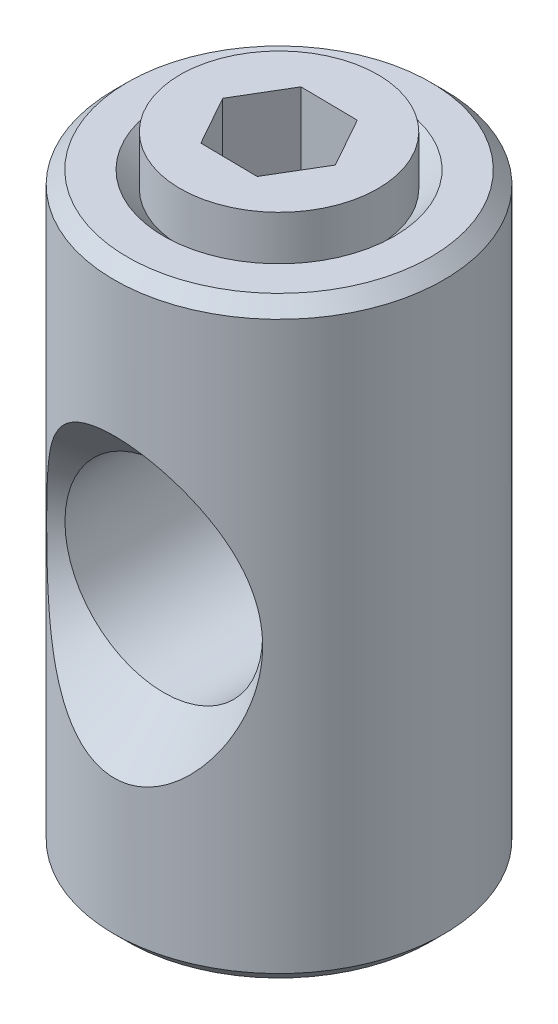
ISO-10303-21;
HEADER;
FILE_DESCRIPTION(('STEP AP214'),'2;1');
FILE_NAME('part.step','',(''),(''),'','','');
FILE_SCHEMA(('AUTOMOTIVE_DESIGN { 1 0 10303 214 1 1 1 1 }'));
ENDSEC;
DATA;
#1=APPLICATION_CONTEXT('core data for automotive mechanical design processes');
#2=APPLICATION_PROTOCOL_DEFINITION('international standard','automotive_design',2000,#1);
#3=PRODUCT_CONTEXT('',#1,'mechanical');
#4=PRODUCT('Part','Part','',(#3));
#5=PRODUCT_RELATED_PRODUCT_CATEGORY('part','',(#4));
#6=PRODUCT_DEFINITION_FORMATION('','',#4);
#7=PRODUCT_DEFINITION_CONTEXT('part definition',#1,'design');
#8=PRODUCT_DEFINITION('design','',#6,#7);
#9=PRODUCT_DEFINITION_SHAPE('','',#8);
#10=(LENGTH_UNIT() NAMED_UNIT(*) SI_UNIT(.MILLI.,.METRE.));
#11=(NAMED_UNIT(*) PLANE_ANGLE_UNIT() SI_UNIT($,.RADIAN.));
#12=(NAMED_UNIT(*) SI_UNIT($,.STERADIAN.) SOLID_ANGLE_UNIT());
#13=UNCERTAINTY_MEASURE_WITH_UNIT(LENGTH_MEASURE(1.E-05),#10,'distance_accuracy_value','');
#14=(GEOMETRIC_REPRESENTATION_CONTEXT(3) GLOBAL_UNCERTAINTY_ASSIGNED_CONTEXT((#13)) GLOBAL_UNIT_ASSIGNED_CONTEXT((#10,
#11,#12)) REPRESENTATION_CONTEXT('',''));
#15=CARTESIAN_POINT('',(0.,0.,0.));
#16=DIRECTION('',(0.,0.,1.));
#17=DIRECTION('',(1.,0.,0.));
#18=AXIS2_PLACEMENT_3D('',#15,#16,#17);
#19=CARTESIAN_POINT('',(0.,2.,0.));
#20=DIRECTION('',(0.,-1.,0.));
#21=DIRECTION('',(0.999915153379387,0.,0.0130263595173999));
#22=AXIS2_PLACEMENT_3D('',#19,#20,#21);
#23=CYLINDRICAL_SURFACE('',#22,1.5);
#24=CARTESIAN_POINT('',(0.,5.,0.));
#25=DIRECTION('',(0.,-1.,0.));
#26=DIRECTION('',(0.999915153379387,0.,0.0130263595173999));
#27=AXIS2_PLACEMENT_3D('',#24,#25,#26);
#28=CIRCLE('',#27,1.5);
#29=CARTESIAN_POINT('',(1.49987273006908,5.,0.0195395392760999));
#30=VERTEX_POINT('',#29);
#31=EDGE_CURVE('E118',#30,#30,#28,.T.);
#32=ORIENTED_EDGE('',*,*,#31,.T.);
#33=EDGE_LOOP('',(#32));
#34=FACE_BOUND('',#33,.T.);
#35=CARTESIAN_POINT('',(0.,4.25,0.));
#36=DIRECTION('',(0.,1.,0.));
#37=DIRECTION('',(-1.,0.,0.));
#38=AXIS2_PLACEMENT_3D('',#35,#36,#37);
#39=CIRCLE('',#38,1.5);
#40=CARTESIAN_POINT('',(-1.5,4.25,0.));
#41=VERTEX_POINT('',#40);
#42=EDGE_CURVE('E9',#41,#41,#39,.T.);
#43=ORIENTED_EDGE('',*,*,#42,.T.);
#44=EDGE_LOOP('',(#43));
#45=FACE_BOUND('',#44,.T.);
#46=ADVANCED_FACE('F14',(#34,#45),#23,.T.);
#47=CARTESIAN_POINT('',(0.,5.,0.));
#48=DIRECTION('',(0.,-1.,0.));
#49=DIRECTION('',(0.999915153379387,0.,0.0130263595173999));
#50=AXIS2_PLACEMENT_3D('',#47,#48,#49);
#51=PLANE('',#50);
#52=DIRECTION('',(0.488676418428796,0.,0.872465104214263));
#53=VECTOR('',#52,1.);
#54=CARTESIAN_POINT('',(-0.865951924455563,5.,-0.0112811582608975));
#55=LINE('',#54,#53);
#56=CARTESIAN_POINT('',(-0.865951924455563,5.,-0.0112811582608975));
#57=VERTEX_POINT('',#56);
#58=CARTESIAN_POINT('',(-0.442745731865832,5.,0.744295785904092));
#59=VERTEX_POINT('',#58);
#60=EDGE_CURVE('E104',#57,#59,#55,.T.);
#61=ORIENTED_EDGE('',*,*,#60,.F.);
#62=DIRECTION('',(-0.511238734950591,0.,0.859438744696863));
#63=VECTOR('',#62,1.);
#64=CARTESIAN_POINT('',(-0.423206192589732,5.,-0.755576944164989));
#65=LINE('',#64,#63);
#66=CARTESIAN_POINT('',(-0.423206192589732,5.,-0.755576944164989));
#67=VERTEX_POINT('',#66);
#68=EDGE_CURVE('E30',#67,#57,#65,.T.);
#69=ORIENTED_EDGE('',*,*,#68,.F.);
#70=DIRECTION('',(-0.999915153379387,0.,-0.0130263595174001));
#71=VECTOR('',#70,1.);
#72=CARTESIAN_POINT('',(0.442745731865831,5.,-0.744295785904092));
#73=LINE('',#72,#71);
#74=CARTESIAN_POINT('',(0.442745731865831,5.,-0.744295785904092));
#75=VERTEX_POINT('',#74);
#76=EDGE_CURVE('E114',#75,#67,#73,.T.);
#77=ORIENTED_EDGE('',*,*,#76,.F.);
#78=DIRECTION('',(-0.488676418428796,0.,-0.872465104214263));
#79=VECTOR('',#78,1.);
#80=CARTESIAN_POINT('',(0.865951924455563,5.,0.0112811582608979));
#81=LINE('',#80,#79);
#82=CARTESIAN_POINT('',(0.865951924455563,5.,0.0112811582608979));
#83=VERTEX_POINT('',#82);
#84=EDGE_CURVE('E112',#83,#75,#81,.T.);
#85=ORIENTED_EDGE('',*,*,#84,.F.);
#86=DIRECTION('',(0.511238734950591,0.,-0.859438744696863));
#87=VECTOR('',#86,1.);
#88=CARTESIAN_POINT('',(0.423206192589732,5.,0.755576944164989));
#89=LINE('',#88,#87);
#90=CARTESIAN_POINT('',(0.423206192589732,5.,0.755576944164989));
#91=VERTEX_POINT('',#90);
#92=EDGE_CURVE('E78',#91,#83,#89,.T.);
#93=ORIENTED_EDGE('',*,*,#92,.F.);
#94=DIRECTION('',(0.999915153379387,0.,0.0130263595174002));
#95=VECTOR('',#94,1.);
#96=CARTESIAN_POINT('',(-0.442745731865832,5.,0.744295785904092));
#97=LINE('',#96,#95);
#98=EDGE_CURVE('E108',#59,#91,#97,.T.);
#99=ORIENTED_EDGE('',*,*,#98,.F.);
#100=EDGE_LOOP('',(#61,#69,#77,#85,#93,#99));
#101=FACE_BOUND('',#100,.T.);
#102=ORIENTED_EDGE('',*,*,#31,.F.);
#103=EDGE_LOOP('',(#102));
#104=FACE_BOUND('',#103,.T.);
#105=ADVANCED_FACE('F226',(#101,#104),#51,.F.);
#106=CARTESIAN_POINT('',(-0.423206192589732,3.8,-0.755576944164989));
#107=DIRECTION('',(-0.859438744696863,0.,-0.511238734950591));
#108=DIRECTION('',(-0.511238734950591,0.,0.859438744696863));
#109=AXIS2_PLACEMENT_3D('',#106,#107,#108);
#110=PLANE('',#109);
#111=ORIENTED_EDGE('',*,*,#68,.T.);
#112=DIRECTION('',(0.,1.,0.));
#113=VECTOR('',#112,1.);
#114=CARTESIAN_POINT('',(-0.865951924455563,3.8,-0.0112811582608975));
#115=LINE('',#114,#113);
#116=CARTESIAN_POINT('',(-0.865951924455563,3.8,-0.0112811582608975));
#117=VERTEX_POINT('',#116);
#118=EDGE_CURVE('E60',#117,#57,#115,.T.);
#119=ORIENTED_EDGE('',*,*,#118,.F.);
#120=DIRECTION('',(-0.511238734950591,0.,0.859438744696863));
#121=VECTOR('',#120,1.);
#122=CARTESIAN_POINT('',(-0.423206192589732,3.8,-0.755576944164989));
#123=LINE('',#122,#121);
#124=CARTESIAN_POINT('',(-0.423206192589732,3.8,-0.755576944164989));
#125=VERTEX_POINT('',#124);
#126=EDGE_CURVE('E116',#125,#117,#123,.T.);
#127=ORIENTED_EDGE('',*,*,#126,.F.);
#128=DIRECTION('',(0.,1.,0.));
#129=VECTOR('',#128,1.);
#130=CARTESIAN_POINT('',(-0.423206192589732,3.8,-0.755576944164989));
#131=LINE('',#130,#129);
#132=EDGE_CURVE('E38',#125,#67,#131,.T.);
#133=ORIENTED_EDGE('',*,*,#132,.T.);
#134=EDGE_LOOP('',(#111,#119,#127,#133));
#135=FACE_BOUND('',#134,.T.);
#136=ADVANCED_FACE('F213',(#135),#110,.F.);
#137=CARTESIAN_POINT('',(0.442745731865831,3.8,-0.744295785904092));
#138=DIRECTION('',(0.0130263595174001,0.,-0.999915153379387));
#139=DIRECTION('',(-0.999915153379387,0.,-0.0130263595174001));
#140=AXIS2_PLACEMENT_3D('',#137,#138,#139);
#141=PLANE('',#140);
#142=ORIENTED_EDGE('',*,*,#76,.T.);
#143=ORIENTED_EDGE('',*,*,#132,.F.);
#144=DIRECTION('',(-0.999915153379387,0.,-0.0130263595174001));
#145=VECTOR('',#144,1.);
#146=CARTESIAN_POINT('',(0.442745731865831,3.8,-0.744295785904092));
#147=LINE('',#146,#145);
#148=CARTESIAN_POINT('',(0.442745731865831,3.8,-0.744295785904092));
#149=VERTEX_POINT('',#148);
#150=EDGE_CURVE('E90',#149,#125,#147,.T.);
#151=ORIENTED_EDGE('',*,*,#150,.F.);
#152=DIRECTION('',(0.,1.,0.));
#153=VECTOR('',#152,1.);
#154=CARTESIAN_POINT('',(0.442745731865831,3.8,-0.744295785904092));
#155=LINE('',#154,#153);
#156=EDGE_CURVE('E82',#149,#75,#155,.T.);
#157=ORIENTED_EDGE('',*,*,#156,.T.);
#158=EDGE_LOOP('',(#142,#143,#151,#157));
#159=FACE_BOUND('',#158,.T.);
#160=ADVANCED_FACE('F210',(#159),#141,.F.);
#161=CARTESIAN_POINT('',(0.865951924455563,3.8,0.0112811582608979));
#162=DIRECTION('',(0.872465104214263,0.,-0.488676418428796));
#163=DIRECTION('',(-0.488676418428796,0.,-0.872465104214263));
#164=AXIS2_PLACEMENT_3D('',#161,#162,#163);
#165=PLANE('',#164);
#166=ORIENTED_EDGE('',*,*,#84,.T.);
#167=ORIENTED_EDGE('',*,*,#156,.F.);
#168=DIRECTION('',(-0.488676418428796,0.,-0.872465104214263));
#169=VECTOR('',#168,1.);
#170=CARTESIAN_POINT('',(0.865951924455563,3.8,0.0112811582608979));
#171=LINE('',#170,#169);
#172=CARTESIAN_POINT('',(0.865951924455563,3.8,0.0112811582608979));
#173=VERTEX_POINT('',#172);
#174=EDGE_CURVE('E86',#173,#149,#171,.T.);
#175=ORIENTED_EDGE('',*,*,#174,.F.);
#176=DIRECTION('',(0.,1.,0.));
#177=VECTOR('',#176,1.);
#178=CARTESIAN_POINT('',(0.865951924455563,3.8,0.0112811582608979));
#179=LINE('',#178,#177);
#180=EDGE_CURVE('E71',#173,#83,#179,.T.);
#181=ORIENTED_EDGE('',*,*,#180,.T.);
#182=EDGE_LOOP('',(#166,#167,#175,#181));
#183=FACE_BOUND('',#182,.T.);
#184=ADVANCED_FACE('F87',(#183),#165,.F.);
#185=CARTESIAN_POINT('',(0.423206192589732,3.8,0.755576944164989));
#186=DIRECTION('',(0.859438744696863,0.,0.511238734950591));
#187=DIRECTION('',(0.511238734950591,0.,-0.859438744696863));
#188=AXIS2_PLACEMENT_3D('',#185,#186,#187);
#189=PLANE('',#188);
#190=ORIENTED_EDGE('',*,*,#92,.T.);
#191=ORIENTED_EDGE('',*,*,#180,.F.);
#192=DIRECTION('',(0.511238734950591,0.,-0.859438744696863));
#193=VECTOR('',#192,1.);
#194=CARTESIAN_POINT('',(0.423206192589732,3.8,0.755576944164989));
#195=LINE('',#194,#193);
#196=CARTESIAN_POINT('',(0.423206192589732,3.8,0.755576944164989));
#197=VERTEX_POINT('',#196);
#198=EDGE_CURVE('E75',#197,#173,#195,.T.);
#199=ORIENTED_EDGE('',*,*,#198,.F.);
#200=DIRECTION('',(0.,1.,0.));
#201=VECTOR('',#200,1.);
#202=CARTESIAN_POINT('',(0.423206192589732,3.8,0.755576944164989));
#203=LINE('',#202,#201);
#204=EDGE_CURVE('E83',#197,#91,#203,.T.);
#205=ORIENTED_EDGE('',*,*,#204,.T.);
#206=EDGE_LOOP('',(#190,#191,#199,#205));
#207=FACE_BOUND('',#206,.T.);
#208=ADVANCED_FACE('F73',(#207),#189,.F.);
#209=CARTESIAN_POINT('',(-0.442745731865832,3.8,0.744295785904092));
#210=DIRECTION('',(-0.0130263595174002,0.,0.999915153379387));
#211=DIRECTION('',(0.999915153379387,0.,0.0130263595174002));
#212=AXIS2_PLACEMENT_3D('',#209,#210,#211);
#213=PLANE('',#212);
#214=ORIENTED_EDGE('',*,*,#98,.T.);
#215=ORIENTED_EDGE('',*,*,#204,.F.);
#216=DIRECTION('',(0.999915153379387,0.,0.0130263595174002));
#217=VECTOR('',#216,1.);
#218=CARTESIAN_POINT('',(-0.442745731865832,3.8,0.744295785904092));
#219=LINE('',#218,#217);
#220=CARTESIAN_POINT('',(-0.442745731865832,3.8,0.744295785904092));
#221=VERTEX_POINT('',#220);
#222=EDGE_CURVE('E96',#221,#197,#219,.T.);
#223=ORIENTED_EDGE('',*,*,#222,.F.);
#224=DIRECTION('',(0.,1.,0.));
#225=VECTOR('',#224,1.);
#226=CARTESIAN_POINT('',(-0.442745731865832,3.8,0.744295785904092));
#227=LINE('',#226,#225);
#228=EDGE_CURVE('E121',#221,#59,#227,.T.);
#229=ORIENTED_EDGE('',*,*,#228,.T.);
#230=EDGE_LOOP('',(#214,#215,#223,#229));
#231=FACE_BOUND('',#230,.T.);
#232=ADVANCED_FACE('F218',(#231),#213,.F.);
#233=CARTESIAN_POINT('',(-0.865951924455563,3.8,-0.0112811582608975));
#234=DIRECTION('',(-0.872465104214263,0.,0.488676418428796));
#235=DIRECTION('',(0.488676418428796,0.,0.872465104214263));
#236=AXIS2_PLACEMENT_3D('',#233,#234,#235);
#237=PLANE('',#236);
#238=ORIENTED_EDGE('',*,*,#60,.T.);
#239=ORIENTED_EDGE('',*,*,#228,.F.);
#240=DIRECTION('',(0.488676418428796,0.,0.872465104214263));
#241=VECTOR('',#240,1.);
#242=CARTESIAN_POINT('',(-0.865951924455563,3.8,-0.0112811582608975));
#243=LINE('',#242,#241);
#244=EDGE_CURVE('E98',#117,#221,#243,.T.);
#245=ORIENTED_EDGE('',*,*,#244,.F.);
#246=ORIENTED_EDGE('',*,*,#118,.T.);
#247=EDGE_LOOP('',(#238,#239,#245,#246));
#248=FACE_BOUND('',#247,.T.);
#249=ADVANCED_FACE('F209',(#248),#237,.F.);
#250=CARTESIAN_POINT('',(-1.30869765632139,3.8,0.733014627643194));
#251=DIRECTION('',(0.,1.,0.));
#252=DIRECTION('',(-0.999915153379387,0.,-0.0130263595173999));
#253=AXIS2_PLACEMENT_3D('',#250,#251,#252);
#254=PLANE('',#253);
#255=ORIENTED_EDGE('',*,*,#126,.T.);
#256=ORIENTED_EDGE('',*,*,#244,.T.);
#257=ORIENTED_EDGE('',*,*,#222,.T.);
#258=ORIENTED_EDGE('',*,*,#198,.T.);
#259=ORIENTED_EDGE('',*,*,#174,.T.);
#260=ORIENTED_EDGE('',*,*,#150,.T.);
#261=EDGE_LOOP('',(#255,#256,#257,#258,#259,#260));
#262=FACE_BOUND('',#261,.T.);
#263=ADVANCED_FACE('F93',(#262),#254,.T.);
#264=CARTESIAN_POINT('',(0.,-4.5,0.));
#265=DIRECTION('',(0.,-1.,0.));
#266=DIRECTION('',(-1.,0.,0.));
#267=AXIS2_PLACEMENT_3D('',#264,#265,#266);
#268=PLANE('',#267);
#269=CARTESIAN_POINT('',(0.,-4.5,0.));
#270=DIRECTION('',(0.,-1.,0.));
#271=DIRECTION('',(-1.,0.,0.));
#272=AXIS2_PLACEMENT_3D('',#269,#270,#271);
#273=CIRCLE('',#272,2.3);
#274=CARTESIAN_POINT('',(-2.3,-4.5,0.));
#275=VERTEX_POINT('',#274);
#276=EDGE_CURVE('E142',#275,#275,#273,.T.);
#277=ORIENTED_EDGE('',*,*,#276,.T.);
#278=EDGE_LOOP('',(#277));
#279=FACE_BOUND('',#278,.T.);
#280=ADVANCED_FACE('F174',(#279),#268,.T.);
#281=CARTESIAN_POINT('',(0.,-4.5,0.));
#282=DIRECTION('',(0.,1.,0.));
#283=DIRECTION('',(1.,0.,0.));
#284=AXIS2_PLACEMENT_3D('',#281,#282,#283);
#285=CONICAL_SURFACE('',#284,2.3,0.785398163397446);
#286=CARTESIAN_POINT('',(0.,-4.3,0.));
#287=DIRECTION('',(0.,-1.,0.));
#288=DIRECTION('',(-1.,0.,0.));
#289=AXIS2_PLACEMENT_3D('',#286,#287,#288);
#290=CIRCLE('',#289,2.5);
#291=CARTESIAN_POINT('',(-2.5,-4.3,0.));
#292=VERTEX_POINT('',#291);
#293=EDGE_CURVE('E128',#292,#292,#290,.F.);
#294=ORIENTED_EDGE('',*,*,#293,.F.);
#295=EDGE_LOOP('',(#294));
#296=FACE_BOUND('',#295,.T.);
#297=ORIENTED_EDGE('',*,*,#276,.F.);
#298=EDGE_LOOP('',(#297));
#299=FACE_BOUND('',#298,.T.);
#300=ADVANCED_FACE('F176',(#296,#299),#285,.T.);
#301=CARTESIAN_POINT('',(0.,-4.5,0.));
#302=DIRECTION('',(0.,1.,0.));
#303=DIRECTION('',(1.,0.,0.));
#304=AXIS2_PLACEMENT_3D('',#301,#302,#303);
#305=CYLINDRICAL_SURFACE('',#304,2.5);
#306=CARTESIAN_POINT('',(1.2192819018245,1.4993158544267,-2.18251046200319));
#307=CARTESIAN_POINT('',(1.16940160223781,1.57579111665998,-2.21037423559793));
#308=CARTESIAN_POINT('',(1.11484384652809,1.64904114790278,-2.23862650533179));
#309=CARTESIAN_POINT('',(0.995605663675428,1.78741572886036,-2.29414338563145));
#310=CARTESIAN_POINT('',(0.930925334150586,1.85254035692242,-2.32140800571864));
#311=CARTESIAN_POINT('',(0.804531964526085,1.96029311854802,-2.36777072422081));
#312=CARTESIAN_POINT('',(0.744667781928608,2.00483575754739,-2.38742806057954));
#313=CARTESIAN_POINT('',(0.618143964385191,2.08476052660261,-2.42326255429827));
#314=CARTESIAN_POINT('',(0.551494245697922,2.12015576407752,-2.43944468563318));
#315=CARTESIAN_POINT('',(0.423705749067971,2.17452311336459,-2.46454572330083));
#316=CARTESIAN_POINT('',(0.363465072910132,2.19523934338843,-2.47422166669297));
#317=CARTESIAN_POINT('',(0.239995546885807,2.22722836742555,-2.48922827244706));
#318=CARTESIAN_POINT('',(0.176768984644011,2.23850827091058,-2.49456220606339));
#319=CARTESIAN_POINT('',(0.0488356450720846,2.25073415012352,-2.50034545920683));
#320=CARTESIAN_POINT('',(-0.0158758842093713,2.25164027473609,-2.50077594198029));
#321=CARTESIAN_POINT('',(-0.144424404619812,2.24293177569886,-2.49665377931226));
#322=CARTESIAN_POINT('',(-0.208261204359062,2.23331488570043,-2.4921000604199));
#323=CARTESIAN_POINT('',(-0.329623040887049,2.20519834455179,-2.47888495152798));
#324=CARTESIAN_POINT('',(-0.387301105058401,2.18722907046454,-2.47046916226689));
#325=CARTESIAN_POINT('',(-0.499112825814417,2.14379170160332,-2.45033060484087));
#326=CARTESIAN_POINT('',(-0.553245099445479,2.11832070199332,-2.43860655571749));
#327=CARTESIAN_POINT('',(-0.682926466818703,2.04706123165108,-2.40624338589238));
#328=CARTESIAN_POINT('',(-0.755977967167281,1.99743200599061,-2.38405039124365));
#329=CARTESIAN_POINT('',(-0.892548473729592,1.88770658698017,-2.33636915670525));
#330=CARTESIAN_POINT('',(-0.956041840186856,1.82758314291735,-2.31087238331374));
#331=CARTESIAN_POINT('',(-1.09869376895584,1.67237771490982,-2.24750524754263));
#332=CARTESIAN_POINT('',(-1.17314335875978,1.57325547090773,-2.20895682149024));
#333=CARTESIAN_POINT('',(-1.30494990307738,1.36364875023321,-2.13374438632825));
#334=CARTESIAN_POINT('',(-1.3622838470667,1.25314924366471,-2.09708296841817));
#335=CARTESIAN_POINT('',(-1.46227961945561,1.02016177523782,-2.02867074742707));
#336=CARTESIAN_POINT('',(-1.50446590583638,0.897418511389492,-1.99709390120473));
#337=CARTESIAN_POINT('',(-1.57194683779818,0.645253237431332,-1.94443937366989));
#338=CARTESIAN_POINT('',(-1.59726159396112,0.515839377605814,-1.92334920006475));
#339=CARTESIAN_POINT('',(-1.62297359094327,0.314233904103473,-1.90159814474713));
#340=CARTESIAN_POINT('',(-1.629480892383,0.243288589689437,-1.8959996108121));
#341=CARTESIAN_POINT('',(-1.63751086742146,0.100889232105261,-1.88907170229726));
#342=CARTESIAN_POINT('',(-1.63903338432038,0.0294351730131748,-1.88774246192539));
#343=CARTESIAN_POINT('',(-1.63707535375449,-0.113340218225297,-1.88944055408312));
#344=CARTESIAN_POINT('',(-1.63359560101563,-0.184661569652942,-1.89246719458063));
#345=CARTESIAN_POINT('',(-1.62166817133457,-0.326565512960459,-1.90269522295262));
#346=CARTESIAN_POINT('',(-1.61322061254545,-0.397148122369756,-1.90989651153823));
#347=CARTESIAN_POINT('',(-1.58227846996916,-0.595582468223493,-1.93574449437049));
#348=CARTESIAN_POINT('',(-1.55394452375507,-0.721992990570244,-1.95892671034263));
#349=CARTESIAN_POINT('',(-1.48087806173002,-0.967994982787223,-2.01471793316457));
#350=CARTESIAN_POINT('',(-1.43610868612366,-1.08757042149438,-2.04734809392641));
#351=CARTESIAN_POINT('',(-1.32473508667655,-1.32841796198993,-2.12131886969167));
#352=CARTESIAN_POINT('',(-1.25644959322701,-1.44875459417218,-2.16319454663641));
#353=CARTESIAN_POINT('',(-1.09818364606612,-1.67383141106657,-2.24766732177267));
#354=CARTESIAN_POINT('',(-1.00828436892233,-1.77862763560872,-2.29026117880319));
#355=CARTESIAN_POINT('',(-0.851072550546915,-1.92272302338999,-2.35142719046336));
#356=CARTESIAN_POINT('',(-0.792030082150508,-1.97016029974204,-2.37212722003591));
#357=CARTESIAN_POINT('',(-0.666828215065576,-2.05613141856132,-2.41031279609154));
#358=CARTESIAN_POINT('',(-0.600679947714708,-2.09467889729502,-2.42780325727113));
#359=CARTESIAN_POINT('',(-0.473152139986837,-2.15511063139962,-2.45553760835));
#360=CARTESIAN_POINT('',(-0.412735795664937,-2.17868262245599,-2.46649639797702));
#361=CARTESIAN_POINT('',(-0.288395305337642,-2.21634103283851,-2.48410106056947));
#362=CARTESIAN_POINT('',(-0.224473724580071,-2.23043429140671,-2.49075004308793));
#363=CARTESIAN_POINT('',(-0.0945074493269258,-2.24803502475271,-2.49906468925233));
#364=CARTESIAN_POINT('',(-0.0284536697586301,-2.25148872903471,-2.50070503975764));
#365=CARTESIAN_POINT('',(0.103222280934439,-2.24733093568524,-2.49873589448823));
#366=CARTESIAN_POINT('',(0.168844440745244,-2.23971914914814,-2.49512626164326));
#367=CARTESIAN_POINT('',(0.292420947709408,-2.2151476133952,-2.48355414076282));
#368=CARTESIAN_POINT('',(0.350571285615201,-2.19897471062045,-2.47595845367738));
#369=CARTESIAN_POINT('',(0.46353461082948,-2.15891298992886,-2.45731952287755));
#370=CARTESIAN_POINT('',(0.518346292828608,-2.13502117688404,-2.44627494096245));
#371=CARTESIAN_POINT('',(0.647723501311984,-2.06850695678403,-2.41591339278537));
#372=CARTESIAN_POINT('',(0.720092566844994,-2.02229259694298,-2.39510961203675));
#373=CARTESIAN_POINT('',(0.855846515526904,-1.91949452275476,-2.35003697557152));
#374=CARTESIAN_POINT('',(0.919208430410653,-1.86288511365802,-2.32575956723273));
#375=CARTESIAN_POINT('',(1.06229589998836,-1.71601627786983,-2.26492567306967));
#376=CARTESIAN_POINT('',(1.13748955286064,-1.62169679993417,-2.22754499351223));
#377=CARTESIAN_POINT('',(1.27146799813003,-1.42172523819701,-2.1538843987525));
#378=CARTESIAN_POINT('',(1.33022907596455,-1.31605707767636,-2.11760614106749));
#379=CARTESIAN_POINT('',(1.43402835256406,-1.0925481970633,-2.04879328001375));
#380=CARTESIAN_POINT('',(1.4785613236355,-0.974424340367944,-2.016417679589));
#381=CARTESIAN_POINT('',(1.55156080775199,-0.731298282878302,-1.96081249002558));
#382=CARTESIAN_POINT('',(1.58004400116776,-0.606303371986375,-1.93757341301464));
#383=CARTESIAN_POINT('',(1.61169536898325,-0.408679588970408,-1.91118786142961));
#384=CARTESIAN_POINT('',(1.6204883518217,-0.337476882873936,-1.90370186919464));
#385=CARTESIAN_POINT('',(1.63301370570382,-0.194289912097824,-1.89297093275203));
#386=CARTESIAN_POINT('',(1.63674588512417,-0.122305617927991,-1.88972614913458));
#387=CARTESIAN_POINT('',(1.63911325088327,0.0218349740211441,-1.88767334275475));
#388=CARTESIAN_POINT('',(1.63774677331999,0.0939913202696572,-1.88886676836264));
#389=CARTESIAN_POINT('',(1.6299308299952,0.237802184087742,-1.89561246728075));
#390=CARTESIAN_POINT('',(1.62348153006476,0.30945671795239,-1.90116459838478));
#391=CARTESIAN_POINT('',(1.59814972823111,0.510259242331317,-1.92260540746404));
#392=CARTESIAN_POINT('',(1.57340409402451,0.63822696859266,-1.94323972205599));
#393=CARTESIAN_POINT('',(1.50753590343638,0.887427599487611,-1.99475580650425));
#394=CARTESIAN_POINT('',(1.46642629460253,1.00866574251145,-2.02562947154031));
#395=CARTESIAN_POINT('',(1.36172119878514,1.25631194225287,-2.09767462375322));
#396=CARTESIAN_POINT('',(1.29603972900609,1.38163262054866,-2.13963255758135));
#397=CARTESIAN_POINT('',(1.2192819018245,1.4993158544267,-2.18251046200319));
#398=B_SPLINE_CURVE_WITH_KNOTS('',3,(#306,#307,#308,#309,#310,#311,#312,#313,#314,#315,#316,
#317,#318,#319,#320,#321,#322,#323,#324,#325,#326,#327,#328,#329,#330,#331,#332,#333,#334,#335,
#336,#337,#338,#339,#340,#341,#342,#343,#344,#345,#346,#347,#348,#349,#350,#351,#352,#353,#354,
#355,#356,#357,#358,#359,#360,#361,#362,#363,#364,#365,#366,#367,#368,#369,#370,#371,#372,#373,
#374,#375,#376,#377,#378,#379,#380,#381,#382,#383,#384,#385,#386,#387,#388,#389,#390,#391,#392,
#393,#394,#395,#396,#397),.UNSPECIFIED.,.T.,.F.,(4,2,2,2,2,2,2,2,2,2,2,2,2,2,2,2,2,2,2,2,2,2,2,
2,2,2,2,2,2,2,2,2,2,2,2,2,2,2,2,2,2,2,2,2,2,4),(0.,0.286133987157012,0.572265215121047,
0.803013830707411,1.03342994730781,1.22592726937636,1.41827943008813,1.61137026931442,
1.80450270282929,1.98676575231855,2.16909947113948,2.44074601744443,2.71310874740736,
3.10049850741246,3.48840675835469,3.88760383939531,4.28632422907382,4.50045058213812,
4.71458366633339,4.92868273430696,5.14277671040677,5.53581200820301,5.92973420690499,
6.36140509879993,6.79147938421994,7.02633803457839,7.26083399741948,7.45734534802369,
7.65371475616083,7.8510749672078,8.04844033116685,8.23019789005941,8.41202606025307,
8.67559276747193,8.93981995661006,9.31663703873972,9.69399514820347,10.0835564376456,
10.4727121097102,10.6888460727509,10.9049882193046,11.1212009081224,11.3374065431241,
11.7314194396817,12.1251212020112,12.5654357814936),.UNSPECIFIED.);
#399=CARTESIAN_POINT('',(1.2192819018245,1.4993158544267,-2.18251046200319));
#400=VERTEX_POINT('',#399);
#401=EDGE_CURVE('E22',#400,#400,#398,.T.);
#402=ORIENTED_EDGE('',*,*,#401,.T.);
#403=EDGE_LOOP('',(#402));
#404=FACE_BOUND('',#403,.T.);
#405=CARTESIAN_POINT('',(1.2192819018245,1.4993158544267,2.18251046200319));
#406=CARTESIAN_POINT('',(1.29395188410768,1.3848424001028,2.14079967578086));
#407=CARTESIAN_POINT('',(1.35815360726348,1.26310919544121,2.09994149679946));
#408=CARTESIAN_POINT('',(1.46701346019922,1.00878910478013,2.02539862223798));
#409=CARTESIAN_POINT('',(1.51161685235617,0.876173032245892,1.99173415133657));
#410=CARTESIAN_POINT('',(1.56401185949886,0.671073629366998,1.9504753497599));
#411=CARTESIAN_POINT('',(1.57909669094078,0.601315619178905,1.93822460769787));
#412=CARTESIAN_POINT('',(1.60423061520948,0.460359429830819,1.91747601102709));
#413=CARTESIAN_POINT('',(1.61428191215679,0.389161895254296,1.90897651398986));
#414=CARTESIAN_POINT('',(1.62928146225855,0.245996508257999,1.89619058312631));
#415=CARTESIAN_POINT('',(1.63423961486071,0.174030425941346,1.89189597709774));
#416=CARTESIAN_POINT('',(1.63904803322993,0.0298026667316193,1.88773204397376));
#417=CARTESIAN_POINT('',(1.63889873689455,-0.0424589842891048,1.88786233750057));
#418=CARTESIAN_POINT('',(1.63369055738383,-0.181401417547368,1.89237038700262));
#419=CARTESIAN_POINT('',(1.62898941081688,-0.248105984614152,1.89643864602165));
#420=CARTESIAN_POINT('',(1.61523080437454,-0.380752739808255,1.90816845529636));
#421=CARTESIAN_POINT('',(1.60617176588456,-0.446694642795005,1.91583130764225));
#422=CARTESIAN_POINT('',(1.57249114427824,-0.64287231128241,1.94374708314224));
#423=CARTESIAN_POINT('',(1.54136953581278,-0.771368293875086,1.96892350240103));
#424=CARTESIAN_POINT('',(1.46126909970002,-1.02315480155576,2.02909618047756));
#425=CARTESIAN_POINT('',(1.41193665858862,-1.14628422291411,2.06428349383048));
#426=CARTESIAN_POINT('',(1.29494532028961,-1.38189262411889,2.13961825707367));
#427=CARTESIAN_POINT('',(1.22730354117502,-1.49438142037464,2.17976105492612));
#428=CARTESIAN_POINT('',(1.09446948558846,-1.674582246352,2.24855710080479));
#429=CARTESIAN_POINT('',(1.03413755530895,-1.74588409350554,2.27720394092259));
#430=CARTESIAN_POINT('',(0.902692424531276,-1.87871923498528,2.33242616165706));
#431=CARTESIAN_POINT('',(0.831598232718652,-1.94026936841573,2.35900507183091));
#432=CARTESIAN_POINT('',(0.697346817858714,-2.03654114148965,2.40153315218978));
#433=CARTESIAN_POINT('',(0.636578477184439,-2.07413272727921,2.4184852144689));
#434=CARTESIAN_POINT('',(0.509195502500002,-2.13982670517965,2.4484647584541));
#435=CARTESIAN_POINT('',(0.442588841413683,-2.16794179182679,2.4614974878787));
#436=CARTESIAN_POINT('',(0.315175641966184,-2.20922114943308,2.48075939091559));
#437=CARTESIAN_POINT('',(0.255006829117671,-2.22399960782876,2.48771770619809));
#438=CARTESIAN_POINT('',(0.132769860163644,-2.24414522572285,2.49722253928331));
#439=CARTESIAN_POINT('',(0.0707028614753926,-2.24951800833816,2.49977169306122));
#440=CARTESIAN_POINT('',(-0.0535994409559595,-2.25042023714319,2.50019905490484));
#441=CARTESIAN_POINT('',(-0.115834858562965,-2.24593693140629,2.49807121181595));
#442=CARTESIAN_POINT('',(-0.238554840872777,-2.22747238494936,2.48935376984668));
#443=CARTESIAN_POINT('',(-0.299038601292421,-2.21348685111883,2.4827621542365));
#444=CARTESIAN_POINT('',(-0.416453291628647,-2.17713958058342,2.46578019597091));
#445=CARTESIAN_POINT('',(-0.473401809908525,-2.15482397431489,2.45541078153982));
#446=CARTESIAN_POINT('',(-0.58326287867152,-2.1030920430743,2.43165988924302));
#447=CARTESIAN_POINT('',(-0.63617373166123,-2.07367275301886,2.41827715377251));
#448=CARTESIAN_POINT('',(-0.766869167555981,-1.99029013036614,2.38093087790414));
#449=CARTESIAN_POINT('',(-0.841399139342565,-1.93195713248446,2.35531653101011));
#450=CARTESIAN_POINT('',(-0.979546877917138,-1.80457690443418,2.30130839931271));
#451=CARTESIAN_POINT('',(-1.04313223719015,-1.7354989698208,2.27290673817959));
#452=CARTESIAN_POINT('',(-1.18318557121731,-1.56023692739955,2.20416616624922));
#453=CARTESIAN_POINT('',(-1.25472706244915,-1.4502180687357,2.16356996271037));
#454=CARTESIAN_POINT('',(-1.37924983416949,-1.21893362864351,2.08639070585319));
#455=CARTESIAN_POINT('',(-1.43221268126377,-1.09765702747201,2.04981166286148));
#456=CARTESIAN_POINT('',(-1.52121192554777,-0.844007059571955,1.9847000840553));
#457=CARTESIAN_POINT('',(-1.55689583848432,-0.711462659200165,1.95633950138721));
#458=CARTESIAN_POINT('',(-1.59637589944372,-0.508505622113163,1.924021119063));
#459=CARTESIAN_POINT('',(-1.6071938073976,-0.440184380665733,1.91495326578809));
#460=CARTESIAN_POINT('',(-1.62411636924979,-0.302574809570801,1.90062461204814));
#461=CARTESIAN_POINT('',(-1.63022310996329,-0.233286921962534,1.89536212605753));
#462=CARTESIAN_POINT('',(-1.63766704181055,-0.0945732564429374,1.88893357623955));
#463=CARTESIAN_POINT('',(-1.63902502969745,-0.0251494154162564,1.88774965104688));
#464=CARTESIAN_POINT('',(-1.63701998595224,0.113579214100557,1.88948863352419));
#465=CARTESIAN_POINT('',(-1.63365687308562,0.182884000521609,1.89241161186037));
#466=CARTESIAN_POINT('',(-1.62223063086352,0.32086772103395,1.90221571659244));
#467=CARTESIAN_POINT('',(-1.61416444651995,0.389546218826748,1.90909941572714));
#468=CARTESIAN_POINT('',(-1.59337912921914,0.525740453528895,1.92647931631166));
#469=CARTESIAN_POINT('',(-1.58065815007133,0.59325571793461,1.93697695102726));
#470=CARTESIAN_POINT('',(-1.5369683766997,0.787249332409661,1.9720807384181));
#471=CARTESIAN_POINT('',(-1.49991365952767,0.911666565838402,2.00084750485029));
#472=CARTESIAN_POINT('',(-1.40903551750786,1.15214873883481,2.06584828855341));
#473=CARTESIAN_POINT('',(-1.35520521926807,1.26821023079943,2.10208536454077));
#474=CARTESIAN_POINT('',(-1.23842890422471,1.47437587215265,2.17262604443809));
#475=CARTESIAN_POINT('',(-1.17769711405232,1.5658684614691,2.20652940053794));
#476=CARTESIAN_POINT('',(-1.04205916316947,1.73793382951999,2.27372529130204));
#477=CARTESIAN_POINT('',(-0.967181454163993,1.81852797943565,2.30701890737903));
#478=CARTESIAN_POINT('',(-0.827946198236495,1.94181141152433,2.35970079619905));
#479=CARTESIAN_POINT('',(-0.767555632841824,1.98849514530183,2.38019409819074));
#480=CARTESIAN_POINT('',(-0.639595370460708,2.07253227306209,2.41771441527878));
#481=CARTESIAN_POINT('',(-0.572036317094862,2.10989923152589,2.43474646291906));
#482=CARTESIAN_POINT('',(-0.443219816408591,2.16713311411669,2.46111125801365));
#483=CARTESIAN_POINT('',(-0.383000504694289,2.1889356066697,2.47127658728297));
#484=CARTESIAN_POINT('',(-0.259378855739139,2.22310863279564,2.48728658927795));
#485=CARTESIAN_POINT('',(-0.195979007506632,2.23548642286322,2.49313458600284));
#486=CARTESIAN_POINT('',(-0.0674470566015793,2.2498405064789,2.49992126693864));
#487=CARTESIAN_POINT('',(-0.0023086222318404,2.25177135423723,2.50083850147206));
#488=CARTESIAN_POINT('',(0.127270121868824,2.24493088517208,2.49759971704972));
#489=CARTESIAN_POINT('',(0.191710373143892,2.23615867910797,2.49344327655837));
#490=CARTESIAN_POINT('',(0.313840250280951,2.20956858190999,2.48093446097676));
#491=CARTESIAN_POINT('',(0.371697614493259,2.19236792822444,2.47286875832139));
#492=CARTESIAN_POINT('',(0.483973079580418,2.15037505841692,2.45336993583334));
#493=CARTESIAN_POINT('',(0.538388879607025,2.12557782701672,2.44193459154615));
#494=CARTESIAN_POINT('',(0.66797701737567,2.05633744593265,2.41041876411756));
#495=CARTESIAN_POINT('',(0.740774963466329,2.00815185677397,2.38880881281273));
#496=CARTESIAN_POINT('',(0.877008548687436,1.90138893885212,2.34223510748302));
#497=CARTESIAN_POINT('',(0.940430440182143,1.84279662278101,2.31726652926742));
#498=CARTESIAN_POINT('',(1.04024183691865,1.736852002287,2.27373828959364));
#499=CARTESIAN_POINT('',(1.07897922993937,1.69151608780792,2.25554446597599));
#500=CARTESIAN_POINT('',(1.15223200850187,1.59768317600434,2.21901656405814));
#501=CARTESIAN_POINT('',(1.18675043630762,1.5491884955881,2.20068259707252));
#502=CARTESIAN_POINT('',(1.2192819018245,1.4993158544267,2.18251046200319));
#503=B_SPLINE_CURVE_WITH_KNOTS('',3,(#405,#406,#407,#408,#409,#410,#411,#412,#413,#414,#415,
#416,#417,#418,#419,#420,#421,#422,#423,#424,#425,#426,#427,#428,#429,#430,#431,#432,#433,#434,
#435,#436,#437,#438,#439,#440,#441,#442,#443,#444,#445,#446,#447,#448,#449,#450,#451,#452,#453,
#454,#455,#456,#457,#458,#459,#460,#461,#462,#463,#464,#465,#466,#467,#468,#469,#470,#471,#472,
#473,#474,#475,#476,#477,#478,#479,#480,#481,#482,#483,#484,#485,#486,#487,#488,#489,#490,#491,
#492,#493,#494,#495,#496,#497,#498,#499,#500,#501,#502),.UNSPECIFIED.,.T.,.F.,(4,2,2,2,2,2,2,2,
2,2,2,2,2,2,2,2,2,2,2,2,2,2,2,2,2,2,2,2,2,2,2,2,2,2,2,2,2,2,2,2,2,2,2,2,2,2,2,2,4),(0.,
0.428477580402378,0.858144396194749,1.0751456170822,1.29205173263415,1.50853544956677,
1.72500060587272,1.92572784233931,2.12652784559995,2.52840004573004,2.93852563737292,
3.34826910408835,3.64050896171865,3.93223855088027,4.15178306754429,4.37103230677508,
4.55725398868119,4.74336430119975,4.92971554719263,5.11615104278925,5.30156905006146,
5.4870645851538,5.77954589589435,6.0728788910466,6.48281517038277,6.89315703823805,
7.3115498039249,7.52062042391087,7.72959838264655,7.93765998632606,8.14572517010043,
8.35392565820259,8.56220881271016,8.95940239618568,9.35675893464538,9.70042954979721,
10.0434161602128,10.2797671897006,10.5157720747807,10.7095127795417,10.903104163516,
11.097537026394,11.2919860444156,11.4739447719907,11.6560238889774,11.9243320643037,
12.1930298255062,12.3798401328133,12.5665149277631),.UNSPECIFIED.);
#504=CARTESIAN_POINT('',(1.2192819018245,1.4993158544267,2.18251046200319));
#505=VERTEX_POINT('',#504);
#506=EDGE_CURVE('E145',#505,#505,#503,.T.);
#507=ORIENTED_EDGE('',*,*,#506,.T.);
#508=EDGE_LOOP('',(#507));
#509=FACE_BOUND('',#508,.T.);
#510=CARTESIAN_POINT('',(0.,4.3,0.));
#511=DIRECTION('',(0.,-1.,0.));
#512=DIRECTION('',(-1.,0.,0.));
#513=AXIS2_PLACEMENT_3D('',#510,#511,#512);
#514=CIRCLE('',#513,2.5);
#515=CARTESIAN_POINT('',(-2.5,4.3,0.));
#516=VERTEX_POINT('',#515);
#517=EDGE_CURVE('E133',#516,#516,#514,.T.);
#518=ORIENTED_EDGE('',*,*,#517,.T.);
#519=EDGE_LOOP('',(#518));
#520=FACE_BOUND('',#519,.T.);
#521=ORIENTED_EDGE('',*,*,#293,.T.);
#522=EDGE_LOOP('',(#521));
#523=FACE_BOUND('',#522,.T.);
#524=ADVANCED_FACE('F157',(#404,#509,#520,#523),#305,.T.);
#525=CARTESIAN_POINT('',(0.,0.,-2.5));
#526=DIRECTION('',(0.,0.,-1.));
#527=DIRECTION('',(0.,-1.,0.));
#528=AXIS2_PLACEMENT_3D('',#525,#526,#527);
#529=CONICAL_SURFACE('',#528,2.25,0.785398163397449);
#530=CARTESIAN_POINT('',(0.,0.,-1.75));
#531=DIRECTION('',(0.,0.,-1.));
#532=DIRECTION('',(-1.,0.,0.));
#533=AXIS2_PLACEMENT_3D('',#530,#531,#532);
#534=CIRCLE('',#533,1.5);
#535=CARTESIAN_POINT('',(-1.5,0.,-1.75));
#536=VERTEX_POINT('',#535);
#537=EDGE_CURVE('E105',#536,#536,#534,.F.);
#538=ORIENTED_EDGE('',*,*,#537,.T.);
#539=EDGE_LOOP('',(#538));
#540=FACE_BOUND('',#539,.T.);
#541=ORIENTED_EDGE('',*,*,#401,.F.);
#542=EDGE_LOOP('',(#541));
#543=FACE_BOUND('',#542,.T.);
#544=ADVANCED_FACE('F166',(#540,#543),#529,.F.);
#545=CARTESIAN_POINT('',(0.,0.,1.5));
#546=DIRECTION('',(0.,0.,1.));
#547=DIRECTION('',(0.,1.,0.));
#548=AXIS2_PLACEMENT_3D('',#545,#546,#547);
#549=CONICAL_SURFACE('',#548,1.25,0.785398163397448);
#550=CARTESIAN_POINT('',(0.,0.,1.75));
#551=DIRECTION('',(0.,0.,1.));
#552=DIRECTION('',(1.,0.,0.));
#553=AXIS2_PLACEMENT_3D('',#550,#551,#552);
#554=CIRCLE('',#553,1.5);
#555=CARTESIAN_POINT('',(1.5,0.,1.75));
#556=VERTEX_POINT('',#555);
#557=EDGE_CURVE('E17',#556,#556,#554,.F.);
#558=ORIENTED_EDGE('',*,*,#557,.T.);
#559=EDGE_LOOP('',(#558));
#560=FACE_BOUND('',#559,.T.);
#561=ORIENTED_EDGE('',*,*,#506,.F.);
#562=EDGE_LOOP('',(#561));
#563=FACE_BOUND('',#562,.T.);
#564=ADVANCED_FACE('F161',(#560,#563),#549,.F.);
#565=CARTESIAN_POINT('',(0.,4.3,0.));
#566=DIRECTION('',(0.,-1.,0.));
#567=DIRECTION('',(-1.,0.,0.));
#568=AXIS2_PLACEMENT_3D('',#565,#566,#567);
#569=CONICAL_SURFACE('',#568,2.5,0.785398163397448);
#570=CARTESIAN_POINT('',(0.,4.5,0.));
#571=DIRECTION('',(0.,-1.,0.));
#572=DIRECTION('',(-1.,0.,0.));
#573=AXIS2_PLACEMENT_3D('',#570,#571,#572);
#574=CIRCLE('',#573,2.3);
#575=CARTESIAN_POINT('',(-2.3,4.5,0.));
#576=VERTEX_POINT('',#575);
#577=EDGE_CURVE('E139',#576,#576,#574,.F.);
#578=ORIENTED_EDGE('',*,*,#577,.F.);
#579=EDGE_LOOP('',(#578));
#580=FACE_BOUND('',#579,.T.);
#581=ORIENTED_EDGE('',*,*,#517,.F.);
#582=EDGE_LOOP('',(#581));
#583=FACE_BOUND('',#582,.T.);
#584=ADVANCED_FACE('F165',(#580,#583),#569,.T.);
#585=CARTESIAN_POINT('',(0.,4.5,0.));
#586=DIRECTION('',(0.,-1.,0.));
#587=DIRECTION('',(-1.,0.,0.));
#588=AXIS2_PLACEMENT_3D('',#585,#586,#587);
#589=PLANE('',#588);
#590=CARTESIAN_POINT('',(0.,4.5,0.));
#591=DIRECTION('',(0.,1.,0.));
#592=DIRECTION('',(1.,0.,0.));
#593=AXIS2_PLACEMENT_3D('',#590,#591,#592);
#594=CIRCLE('',#593,1.75);
#595=CARTESIAN_POINT('',(1.75,4.5,0.));
#596=VERTEX_POINT('',#595);
#597=EDGE_CURVE('E124',#596,#596,#594,.T.);
#598=ORIENTED_EDGE('',*,*,#597,.F.);
#599=EDGE_LOOP('',(#598));
#600=FACE_BOUND('',#599,.T.);
#601=ORIENTED_EDGE('',*,*,#577,.T.);
#602=EDGE_LOOP('',(#601));
#603=FACE_BOUND('',#602,.T.);
#604=ADVANCED_FACE('F178',(#600,#603),#589,.F.);
#605=CARTESIAN_POINT('',(0.,4.5,0.));
#606=DIRECTION('',(0.,1.,0.));
#607=DIRECTION('',(1.,0.,0.));
#608=AXIS2_PLACEMENT_3D('',#605,#606,#607);
#609=CONICAL_SURFACE('',#608,1.75,0.785398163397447);
#610=ORIENTED_EDGE('',*,*,#597,.T.);
#611=EDGE_LOOP('',(#610));
#612=FACE_BOUND('',#611,.T.);
#613=ORIENTED_EDGE('',*,*,#42,.F.);
#614=EDGE_LOOP('',(#613));
#615=FACE_BOUND('',#614,.T.);
#616=ADVANCED_FACE('F168',(#612,#615),#609,.F.);
#617=CARTESIAN_POINT('',(0.,0.,-2.5));
#618=DIRECTION('',(0.,0.,1.));
#619=DIRECTION('',(1.,0.,0.));
#620=AXIS2_PLACEMENT_3D('',#617,#618,#619);
#621=CYLINDRICAL_SURFACE('',#620,1.5);
#622=ORIENTED_EDGE('',*,*,#557,.F.);
#623=EDGE_LOOP('',(#622));
#624=FACE_BOUND('',#623,.T.);
#625=ORIENTED_EDGE('',*,*,#537,.F.);
#626=EDGE_LOOP('',(#625));
#627=FACE_BOUND('',#626,.T.);
#628=ADVANCED_FACE('F187',(#624,#627),#621,.F.);
#629=CLOSED_SHELL('',(#46,#105,#136,#160,#184,#208,#232,#249,#263,#280,#300,#524,#544,#564,#584,
#604,#616,#628));
#630=MANIFOLD_SOLID_BREP('B1',#629);
#631=ADVANCED_BREP_SHAPE_REPRESENTATION('',(#18,#630),#14);
#632=SHAPE_DEFINITION_REPRESENTATION(#9,#631);
ENDSEC;
END-ISO-10303-21;
